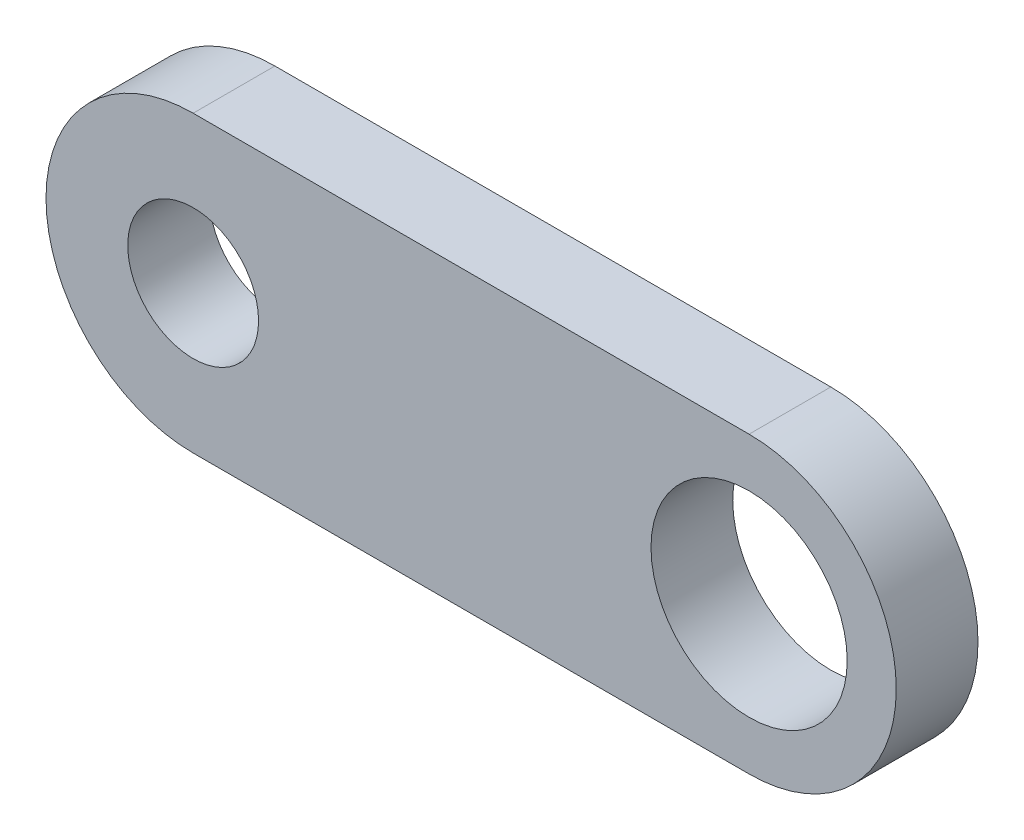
from build123d import *

# Parameters (mm, degrees)
ESQUISSE1_R   = 4
ESQUISSE1_R_2 = 6
MATI_RE_DEPTH = 5


with BuildPart() as part:
    # Esquisse1 → mati_re (new body)
    with BuildSketch(Plane.XY):
        with BuildLine():
            Line((0, 9), (34, 9))
            ThreePointArc((34, 9), (43, 0), (34, -9))
            Line((34, -9), (0, -9))
            ThreePointArc((0, -9), (-9, 0), (0, 9))
        make_face()
        Circle(ESQUISSE1_R, mode=Mode.SUBTRACT)
        with Locations((34, 0)):
            Circle(ESQUISSE1_R_2, mode=Mode.SUBTRACT)
    extrude(amount=MATI_RE_DEPTH)


solid = part.part
